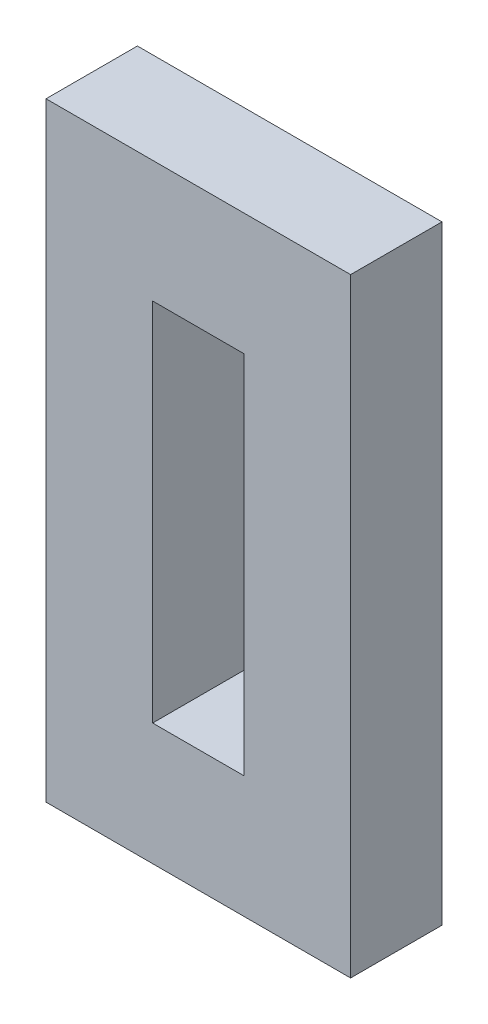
from build123d import *

# Parameters (mm, degrees)
ESQUISSE1_W          = 10
ESQUISSE1_H          = 20
ESQUISSE1_W_2        = 3
ESQUISSE1_H_2        = 12
BASE_EXTRUSION_DEPTH = 3


with BuildPart() as part:
    # Esquisse1 → Base-Extrusion (new body)
    with BuildSketch(Plane.XY):
        with Locations((5, 10)):
            Rectangle(ESQUISSE1_W, ESQUISSE1_H)
        with Locations((5, 10)):
            Rectangle(ESQUISSE1_W_2, ESQUISSE1_H_2, mode=Mode.SUBTRACT)
    extrude(amount=BASE_EXTRUSION_DEPTH)


solid = part.part
